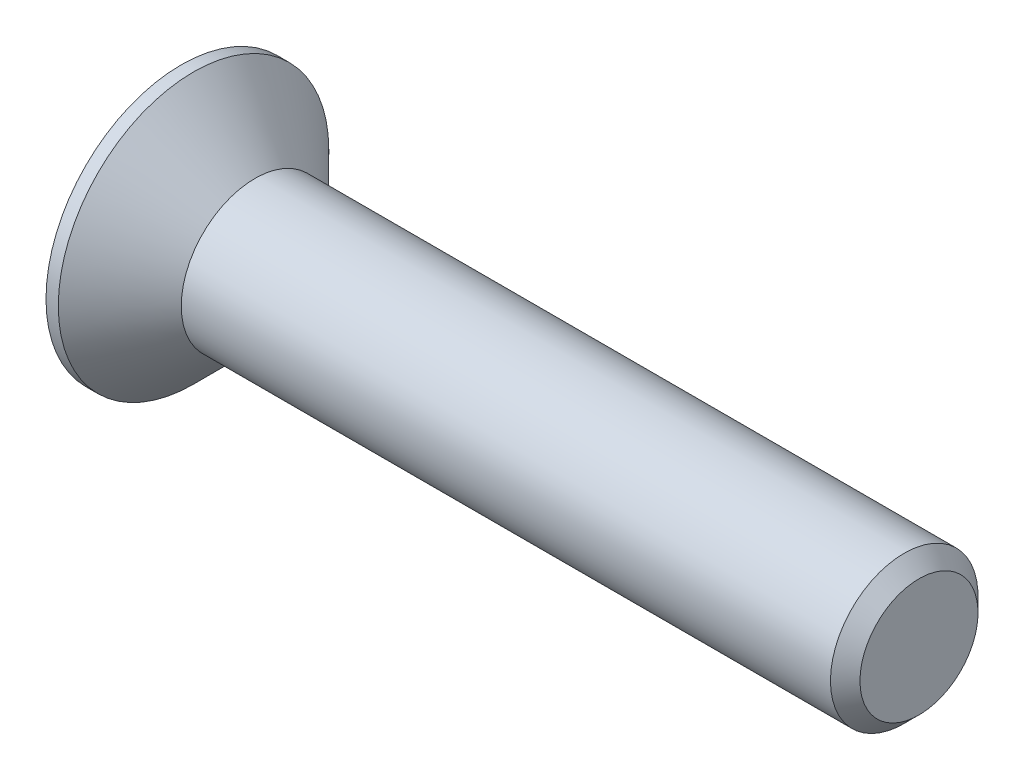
from build123d import *

# Parameters (mm, degrees)
CHAMFER1_SIZE      = 0.6
CUT_EXTRUDE1_DEPTH = 2.5


with BuildPart() as part:
    # Sketch1 → Revolve1 (revolve)
    with BuildSketch(Plane.XY, mode=Mode.PRIVATE) as revolve1_sk:
        Polygon((-3, 5.5), (-3, 0), (27, 0), (27, 3), (0, 3), (-2.5, 5.5), align=None)
    revolve(revolve1_sk.sketch.rotate(Axis((-3, 0, 0), (1, 0, 0)), 90), axis=Axis((-3, 0, 0), (1, 0, 0)))

    # Chamfer1
    chamfer1_edges = [part.edges().sort_by_distance(p)[0] for p in [
        (27, 0, -3),
    ]]
    chamfer(chamfer1_edges, length=CHAMFER1_SIZE)

    # Sketch2 → Cut-Extrude1 (cut)
    with BuildSketch(Plane.ZY.offset(3)):
        Polygon((-0.825, 3.3), (0.825, 3.3), (0.825, 0.825), (3.3, 0.825), (3.3, -0.825), (0.825, -0.825), (0.825, -3.3), (-0.825, -3.3), (-0.825, -0.825), (-3.3, -0.825), (-3.3, 0.825), (-0.825, 0.825), align=None)
    extrude(amount=-CUT_EXTRUDE1_DEPTH, mode=Mode.SUBTRACT)


solid = part.part
